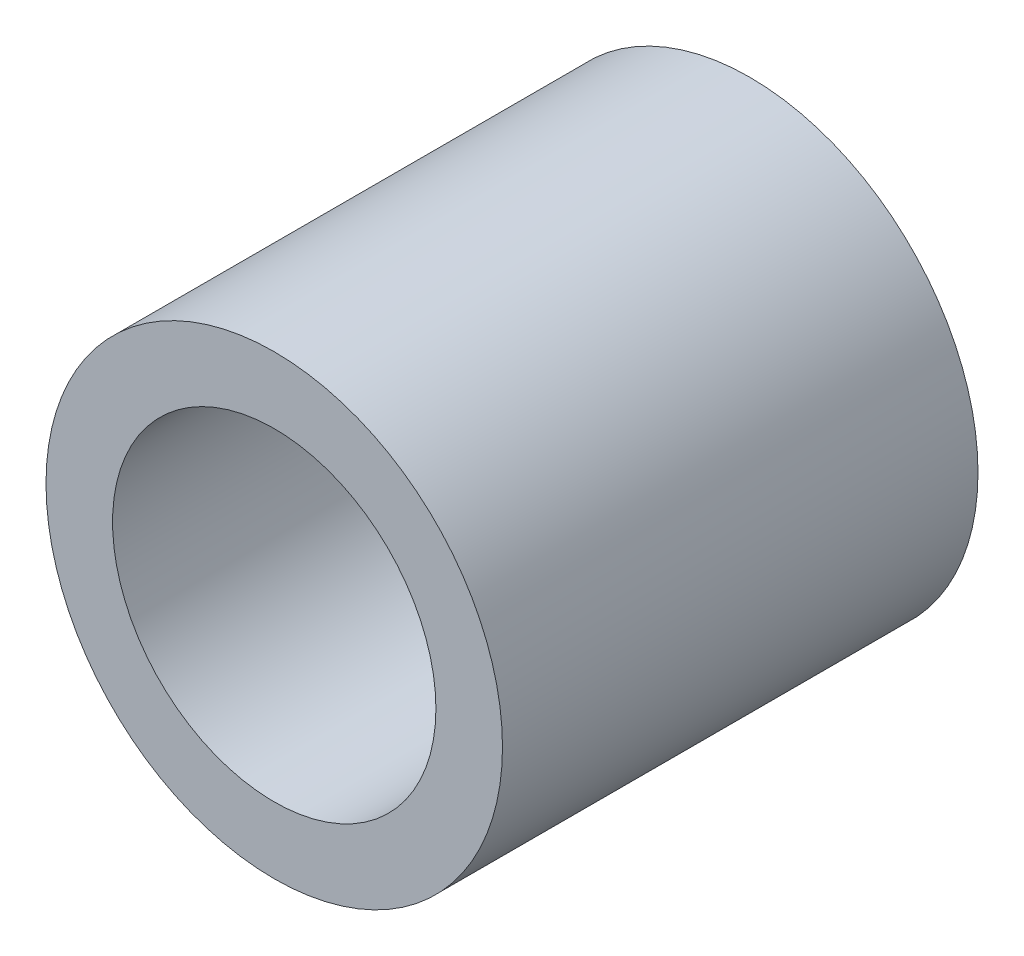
ISO-10303-21;
HEADER;
FILE_DESCRIPTION(('STEP AP214'),'2;1');
FILE_NAME('part.step','',(''),(''),'','','');
FILE_SCHEMA(('AUTOMOTIVE_DESIGN { 1 0 10303 214 1 1 1 1 }'));
ENDSEC;
DATA;
#1=APPLICATION_CONTEXT('core data for automotive mechanical design processes');
#2=APPLICATION_PROTOCOL_DEFINITION('international standard','automotive_design',2000,#1);
#3=PRODUCT_CONTEXT('',#1,'mechanical');
#4=PRODUCT('Part','Part','',(#3));
#5=PRODUCT_RELATED_PRODUCT_CATEGORY('part','',(#4));
#6=PRODUCT_DEFINITION_FORMATION('','',#4);
#7=PRODUCT_DEFINITION_CONTEXT('part definition',#1,'design');
#8=PRODUCT_DEFINITION('design','',#6,#7);
#9=PRODUCT_DEFINITION_SHAPE('','',#8);
#10=(LENGTH_UNIT() NAMED_UNIT(*) SI_UNIT(.MILLI.,.METRE.));
#11=(NAMED_UNIT(*) PLANE_ANGLE_UNIT() SI_UNIT($,.RADIAN.));
#12=(NAMED_UNIT(*) SI_UNIT($,.STERADIAN.) SOLID_ANGLE_UNIT());
#13=UNCERTAINTY_MEASURE_WITH_UNIT(LENGTH_MEASURE(1.E-05),#10,'distance_accuracy_value','');
#14=(GEOMETRIC_REPRESENTATION_CONTEXT(3) GLOBAL_UNCERTAINTY_ASSIGNED_CONTEXT((#13)) GLOBAL_UNIT_ASSIGNED_CONTEXT((#10,
#11,#12)) REPRESENTATION_CONTEXT('',''));
#15=CARTESIAN_POINT('',(0.,0.,0.));
#16=DIRECTION('',(0.,0.,1.));
#17=DIRECTION('',(1.,0.,0.));
#18=AXIS2_PLACEMENT_3D('',#15,#16,#17);
#19=CARTESIAN_POINT('',(0.,0.,25.));
#20=DIRECTION('',(0.,0.,1.));
#21=DIRECTION('',(1.,0.,0.));
#22=AXIS2_PLACEMENT_3D('',#19,#20,#21);
#23=PLANE('',#22);
#24=CARTESIAN_POINT('',(0.,0.,25.));
#25=DIRECTION('',(0.,0.,1.));
#26=DIRECTION('',(1.,0.,0.));
#27=AXIS2_PLACEMENT_3D('',#24,#25,#26);
#28=CIRCLE('',#27,12.);
#29=CARTESIAN_POINT('',(12.,0.,25.));
#30=VERTEX_POINT('',#29);
#31=EDGE_CURVE('E10',#30,#30,#28,.T.);
#32=ORIENTED_EDGE('',*,*,#31,.T.);
#33=EDGE_LOOP('',(#32));
#34=FACE_BOUND('',#33,.T.);
#35=CARTESIAN_POINT('',(0.,0.,25.));
#36=DIRECTION('',(0.,0.,1.));
#37=DIRECTION('',(1.,0.,0.));
#38=AXIS2_PLACEMENT_3D('',#35,#36,#37);
#39=CIRCLE('',#38,8.5);
#40=CARTESIAN_POINT('',(8.5,0.,25.));
#41=VERTEX_POINT('',#40);
#42=EDGE_CURVE('E43',#41,#41,#39,.T.);
#43=ORIENTED_EDGE('',*,*,#42,.F.);
#44=EDGE_LOOP('',(#43));
#45=FACE_BOUND('',#44,.T.);
#46=ADVANCED_FACE('F32',(#34,#45),#23,.T.);
#47=CARTESIAN_POINT('',(0.,0.,0.));
#48=DIRECTION('',(0.,0.,1.));
#49=DIRECTION('',(1.,0.,0.));
#50=AXIS2_PLACEMENT_3D('',#47,#48,#49);
#51=PLANE('',#50);
#52=CARTESIAN_POINT('',(0.,0.,0.));
#53=DIRECTION('',(0.,0.,1.));
#54=DIRECTION('',(1.,0.,0.));
#55=AXIS2_PLACEMENT_3D('',#52,#53,#54);
#56=CIRCLE('',#55,12.);
#57=CARTESIAN_POINT('',(12.,0.,0.));
#58=VERTEX_POINT('',#57);
#59=EDGE_CURVE('E39',#58,#58,#56,.T.);
#60=ORIENTED_EDGE('',*,*,#59,.F.);
#61=EDGE_LOOP('',(#60));
#62=FACE_BOUND('',#61,.T.);
#63=CARTESIAN_POINT('',(0.,0.,0.));
#64=DIRECTION('',(0.,0.,1.));
#65=DIRECTION('',(1.,0.,0.));
#66=AXIS2_PLACEMENT_3D('',#63,#64,#65);
#67=CIRCLE('',#66,8.5);
#68=CARTESIAN_POINT('',(8.5,0.,0.));
#69=VERTEX_POINT('',#68);
#70=EDGE_CURVE('E47',#69,#69,#67,.T.);
#71=ORIENTED_EDGE('',*,*,#70,.T.);
#72=EDGE_LOOP('',(#71));
#73=FACE_BOUND('',#72,.T.);
#74=ADVANCED_FACE('F53',(#62,#73),#51,.F.);
#75=CARTESIAN_POINT('',(0.,0.,25.));
#76=DIRECTION('',(0.,0.,-1.));
#77=DIRECTION('',(-1.,0.,0.));
#78=AXIS2_PLACEMENT_3D('',#75,#76,#77);
#79=CYLINDRICAL_SURFACE('',#78,12.);
#80=ORIENTED_EDGE('',*,*,#31,.F.);
#81=EDGE_LOOP('',(#80));
#82=FACE_BOUND('',#81,.T.);
#83=ORIENTED_EDGE('',*,*,#59,.T.);
#84=EDGE_LOOP('',(#83));
#85=FACE_BOUND('',#84,.T.);
#86=ADVANCED_FACE('F34',(#82,#85),#79,.T.);
#87=CARTESIAN_POINT('',(0.,0.,25.));
#88=DIRECTION('',(0.,0.,-1.));
#89=DIRECTION('',(-1.,0.,0.));
#90=AXIS2_PLACEMENT_3D('',#87,#88,#89);
#91=CYLINDRICAL_SURFACE('',#90,8.5);
#92=ORIENTED_EDGE('',*,*,#42,.T.);
#93=EDGE_LOOP('',(#92));
#94=FACE_BOUND('',#93,.T.);
#95=ORIENTED_EDGE('',*,*,#70,.F.);
#96=EDGE_LOOP('',(#95));
#97=FACE_BOUND('',#96,.T.);
#98=ADVANCED_FACE('F55',(#94,#97),#91,.F.);
#99=CLOSED_SHELL('',(#46,#74,#86,#98));
#100=MANIFOLD_SOLID_BREP('B2',#99);
#101=ADVANCED_BREP_SHAPE_REPRESENTATION('',(#18,#100),#14);
#102=SHAPE_DEFINITION_REPRESENTATION(#9,#101);
ENDSEC;
END-ISO-10303-21;
